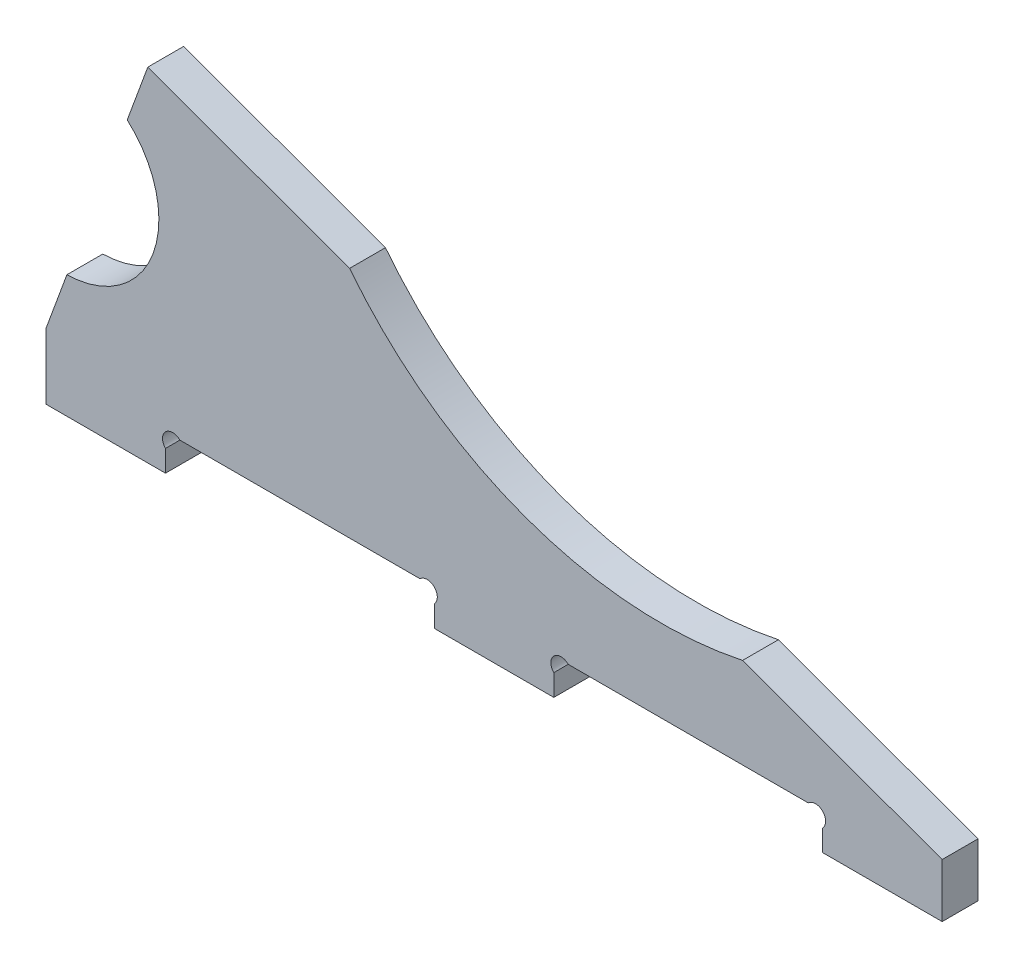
ISO-10303-21;
HEADER;
FILE_DESCRIPTION(('STEP AP214'),'2;1');
FILE_NAME('part.step','',(''),(''),'','','');
FILE_SCHEMA(('AUTOMOTIVE_DESIGN { 1 0 10303 214 1 1 1 1 }'));
ENDSEC;
DATA;
#1=APPLICATION_CONTEXT('core data for automotive mechanical design processes');
#2=APPLICATION_PROTOCOL_DEFINITION('international standard','automotive_design',2000,#1);
#3=PRODUCT_CONTEXT('',#1,'mechanical');
#4=PRODUCT('Part','Part','',(#3));
#5=PRODUCT_RELATED_PRODUCT_CATEGORY('part','',(#4));
#6=PRODUCT_DEFINITION_FORMATION('','',#4);
#7=PRODUCT_DEFINITION_CONTEXT('part definition',#1,'design');
#8=PRODUCT_DEFINITION('design','',#6,#7);
#9=PRODUCT_DEFINITION_SHAPE('','',#8);
#10=(LENGTH_UNIT() NAMED_UNIT(*) SI_UNIT(.MILLI.,.METRE.));
#11=(NAMED_UNIT(*) PLANE_ANGLE_UNIT() SI_UNIT($,.RADIAN.));
#12=(NAMED_UNIT(*) SI_UNIT($,.STERADIAN.) SOLID_ANGLE_UNIT());
#13=UNCERTAINTY_MEASURE_WITH_UNIT(LENGTH_MEASURE(1.E-05),#10,'distance_accuracy_value','');
#14=(GEOMETRIC_REPRESENTATION_CONTEXT(3) GLOBAL_UNCERTAINTY_ASSIGNED_CONTEXT((#13)) GLOBAL_UNIT_ASSIGNED_CONTEXT((#10,
#11,#12)) REPRESENTATION_CONTEXT('',''));
#15=CARTESIAN_POINT('',(0.,0.,0.));
#16=DIRECTION('',(0.,0.,1.));
#17=DIRECTION('',(1.,0.,0.));
#18=AXIS2_PLACEMENT_3D('',#15,#16,#17);
#19=CARTESIAN_POINT('',(116.592002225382,21.1595167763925,6.));
#20=DIRECTION('',(-0.342020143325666,-0.939692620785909,0.));
#21=DIRECTION('',(0.93969262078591,-0.342020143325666,0.));
#22=AXIS2_PLACEMENT_3D('',#19,#20,#21);
#23=PLANE('',#22);
#24=DIRECTION('',(-0.93969262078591,0.342020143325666,0.));
#25=VECTOR('',#24,1.);
#26=CARTESIAN_POINT('',(116.592002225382,21.1595167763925,0.));
#27=LINE('',#26,#25);
#28=CARTESIAN_POINT('',(150.,9.,0.));
#29=VERTEX_POINT('',#28);
#30=CARTESIAN_POINT('',(116.592002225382,21.1595167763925,0.));
#31=VERTEX_POINT('',#30);
#32=EDGE_CURVE('E172',#29,#31,#27,.T.);
#33=ORIENTED_EDGE('',*,*,#32,.T.);
#34=DIRECTION('',(0.,0.,-1.));
#35=VECTOR('',#34,1.);
#36=CARTESIAN_POINT('',(116.592002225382,21.1595167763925,6.));
#37=LINE('',#36,#35);
#38=CARTESIAN_POINT('',(116.592002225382,21.1595167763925,6.));
#39=VERTEX_POINT('',#38);
#40=EDGE_CURVE('E11',#39,#31,#37,.T.);
#41=ORIENTED_EDGE('',*,*,#40,.F.);
#42=DIRECTION('',(-0.93969262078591,0.342020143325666,0.));
#43=VECTOR('',#42,1.);
#44=CARTESIAN_POINT('',(116.592002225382,21.1595167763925,6.));
#45=LINE('',#44,#43);
#46=CARTESIAN_POINT('',(150.,9.,6.));
#47=VERTEX_POINT('',#46);
#48=EDGE_CURVE('E225',#47,#39,#45,.T.);
#49=ORIENTED_EDGE('',*,*,#48,.F.);
#50=DIRECTION('',(0.,0.,-1.));
#51=VECTOR('',#50,1.);
#52=CARTESIAN_POINT('',(150.,9.,6.));
#53=LINE('',#52,#51);
#54=EDGE_CURVE('E185',#47,#29,#53,.T.);
#55=ORIENTED_EDGE('',*,*,#54,.T.);
#56=EDGE_LOOP('',(#33,#41,#49,#55));
#57=FACE_BOUND('',#56,.T.);
#58=ADVANCED_FACE('F26',(#57),#23,.F.);
#59=CARTESIAN_POINT('',(102.941393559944,85.9879317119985,6.));
#60=DIRECTION('',(0.,0.,-1.));
#61=DIRECTION('',(-1.,0.,0.));
#62=AXIS2_PLACEMENT_3D('',#59,#60,#61);
#63=CYLINDRICAL_SURFACE('',#62,66.2500000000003);
#64=CARTESIAN_POINT('',(102.941393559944,85.9879317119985,0.));
#65=DIRECTION('',(0.,0.,-1.));
#66=DIRECTION('',(-1.,0.,0.));
#67=AXIS2_PLACEMENT_3D('',#64,#65,#66);
#68=CIRCLE('',#67,66.2500000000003);
#69=CARTESIAN_POINT('',(50.8135187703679,45.1009268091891,0.));
#70=VERTEX_POINT('',#69);
#71=EDGE_CURVE('E168',#31,#70,#68,.T.);
#72=ORIENTED_EDGE('',*,*,#71,.T.);
#73=DIRECTION('',(0.,0.,-1.));
#74=VECTOR('',#73,1.);
#75=CARTESIAN_POINT('',(50.8135187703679,45.1009268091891,6.));
#76=LINE('',#75,#74);
#77=CARTESIAN_POINT('',(50.8135187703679,45.1009268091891,6.));
#78=VERTEX_POINT('',#77);
#79=EDGE_CURVE('E33',#78,#70,#76,.T.);
#80=ORIENTED_EDGE('',*,*,#79,.F.);
#81=CARTESIAN_POINT('',(102.941393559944,85.9879317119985,6.));
#82=DIRECTION('',(0.,0.,-1.));
#83=DIRECTION('',(-1.,0.,0.));
#84=AXIS2_PLACEMENT_3D('',#81,#82,#83);
#85=CIRCLE('',#84,66.2500000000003);
#86=EDGE_CURVE('E181',#39,#78,#85,.T.);
#87=ORIENTED_EDGE('',*,*,#86,.F.);
#88=ORIENTED_EDGE('',*,*,#40,.T.);
#89=EDGE_LOOP('',(#72,#80,#87,#88));
#90=FACE_BOUND('',#89,.T.);
#91=ADVANCED_FACE('F180',(#90),#63,.F.);
#92=CARTESIAN_POINT('',(17.0424153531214,57.3926032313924,6.));
#93=DIRECTION('',(-0.342020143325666,-0.93969262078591,0.));
#94=DIRECTION('',(0.93969262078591,-0.342020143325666,0.));
#95=AXIS2_PLACEMENT_3D('',#92,#93,#94);
#96=PLANE('',#95);
#97=DIRECTION('',(-0.939692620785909,0.342020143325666,0.));
#98=VECTOR('',#97,1.);
#99=CARTESIAN_POINT('',(17.0424153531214,57.3926032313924,0.));
#100=LINE('',#99,#98);
#101=CARTESIAN_POINT('',(17.0424153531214,57.3926032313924,0.));
#102=VERTEX_POINT('',#101);
#103=EDGE_CURVE('E174',#70,#102,#100,.T.);
#104=ORIENTED_EDGE('',*,*,#103,.T.);
#105=DIRECTION('',(0.,0.,-1.));
#106=VECTOR('',#105,1.);
#107=CARTESIAN_POINT('',(17.0424153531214,57.3926032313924,6.));
#108=LINE('',#107,#106);
#109=CARTESIAN_POINT('',(17.0424153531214,57.3926032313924,6.));
#110=VERTEX_POINT('',#109);
#111=EDGE_CURVE('E316',#110,#102,#108,.T.);
#112=ORIENTED_EDGE('',*,*,#111,.F.);
#113=DIRECTION('',(-0.939692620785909,0.342020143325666,0.));
#114=VECTOR('',#113,1.);
#115=CARTESIAN_POINT('',(17.0424153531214,57.3926032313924,6.));
#116=LINE('',#115,#114);
#117=EDGE_CURVE('E228',#78,#110,#116,.T.);
#118=ORIENTED_EDGE('',*,*,#117,.F.);
#119=ORIENTED_EDGE('',*,*,#79,.T.);
#120=EDGE_LOOP('',(#104,#112,#118,#119));
#121=FACE_BOUND('',#120,.T.);
#122=ADVANCED_FACE('F320',(#121),#96,.F.);
#123=CARTESIAN_POINT('',(13.5941835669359,48.0058792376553,6.));
#124=DIRECTION('',(0.93866822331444,-0.344821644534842,0.));
#125=DIRECTION('',(0.344821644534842,0.93866822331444,0.));
#126=AXIS2_PLACEMENT_3D('',#123,#124,#125);
#127=PLANE('',#126);
#128=DIRECTION('',(-0.344821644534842,-0.93866822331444,0.));
#129=VECTOR('',#128,1.);
#130=CARTESIAN_POINT('',(13.5941835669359,48.0058792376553,0.));
#131=LINE('',#130,#129);
#132=CARTESIAN_POINT('',(13.5941835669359,48.0058792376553,0.));
#133=VERTEX_POINT('',#132);
#134=EDGE_CURVE('E189',#102,#133,#131,.T.);
#135=ORIENTED_EDGE('',*,*,#134,.T.);
#136=DIRECTION('',(0.,0.,-1.));
#137=VECTOR('',#136,1.);
#138=CARTESIAN_POINT('',(13.5941835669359,48.0058792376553,6.));
#139=LINE('',#138,#137);
#140=CARTESIAN_POINT('',(13.5941835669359,48.0058792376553,6.));
#141=VERTEX_POINT('',#140);
#142=EDGE_CURVE('E313',#141,#133,#139,.T.);
#143=ORIENTED_EDGE('',*,*,#142,.F.);
#144=DIRECTION('',(-0.344821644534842,-0.93866822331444,0.));
#145=VECTOR('',#144,1.);
#146=CARTESIAN_POINT('',(13.5941835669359,48.0058792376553,6.));
#147=LINE('',#146,#145);
#148=EDGE_CURVE('E230',#110,#141,#147,.T.);
#149=ORIENTED_EDGE('',*,*,#148,.F.);
#150=ORIENTED_EDGE('',*,*,#111,.T.);
#151=EDGE_LOOP('',(#135,#143,#149,#150));
#152=FACE_BOUND('',#151,.T.);
#153=ADVANCED_FACE('F328',(#152),#127,.F.);
#154=CARTESIAN_POINT('',(3.17954320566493,36.2347977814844,6.));
#155=DIRECTION('',(0.,0.,-1.));
#156=DIRECTION('',(-1.,0.,0.));
#157=AXIS2_PLACEMENT_3D('',#154,#155,#156);
#158=CYLINDRICAL_SURFACE('',#157,15.7169682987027);
#159=CARTESIAN_POINT('',(3.17954320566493,36.2347977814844,0.));
#160=DIRECTION('',(0.,0.,-1.));
#161=DIRECTION('',(-1.,0.,0.));
#162=AXIS2_PLACEMENT_3D('',#159,#160,#161);
#163=CIRCLE('',#162,15.7169682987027);
#164=CARTESIAN_POINT('',(3.49757579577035,20.5210475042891,0.));
#165=VERTEX_POINT('',#164);
#166=EDGE_CURVE('E191',#133,#165,#163,.T.);
#167=ORIENTED_EDGE('',*,*,#166,.T.);
#168=DIRECTION('',(0.,0.,-1.));
#169=VECTOR('',#168,1.);
#170=CARTESIAN_POINT('',(3.49757579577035,20.5210475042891,6.));
#171=LINE('',#170,#169);
#172=CARTESIAN_POINT('',(3.49757579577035,20.5210475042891,6.));
#173=VERTEX_POINT('',#172);
#174=EDGE_CURVE('E310',#173,#165,#171,.T.);
#175=ORIENTED_EDGE('',*,*,#174,.F.);
#176=CARTESIAN_POINT('',(3.17954320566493,36.2347977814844,6.));
#177=DIRECTION('',(0.,0.,-1.));
#178=DIRECTION('',(-1.,0.,0.));
#179=AXIS2_PLACEMENT_3D('',#176,#177,#178);
#180=CIRCLE('',#179,15.7169682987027);
#181=EDGE_CURVE('E232',#141,#173,#180,.T.);
#182=ORIENTED_EDGE('',*,*,#181,.F.);
#183=ORIENTED_EDGE('',*,*,#142,.T.);
#184=EDGE_LOOP('',(#167,#175,#182,#183));
#185=FACE_BOUND('',#184,.T.);
#186=ADVANCED_FACE('F331',(#185),#158,.F.);
#187=CARTESIAN_POINT('',(0.,11.,6.));
#188=DIRECTION('',(0.938668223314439,-0.344821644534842,0.));
#189=DIRECTION('',(0.344821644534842,0.93866822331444,0.));
#190=AXIS2_PLACEMENT_3D('',#187,#188,#189);
#191=PLANE('',#190);
#192=DIRECTION('',(-0.344821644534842,-0.93866822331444,0.));
#193=VECTOR('',#192,1.);
#194=CARTESIAN_POINT('',(0.,11.,0.));
#195=LINE('',#194,#193);
#196=CARTESIAN_POINT('',(0.,11.,0.));
#197=VERTEX_POINT('',#196);
#198=EDGE_CURVE('E193',#165,#197,#195,.T.);
#199=ORIENTED_EDGE('',*,*,#198,.T.);
#200=DIRECTION('',(0.,0.,-1.));
#201=VECTOR('',#200,1.);
#202=CARTESIAN_POINT('',(0.,11.,6.));
#203=LINE('',#202,#201);
#204=CARTESIAN_POINT('',(0.,11.,6.));
#205=VERTEX_POINT('',#204);
#206=EDGE_CURVE('E307',#205,#197,#203,.T.);
#207=ORIENTED_EDGE('',*,*,#206,.F.);
#208=DIRECTION('',(-0.344821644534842,-0.93866822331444,0.));
#209=VECTOR('',#208,1.);
#210=CARTESIAN_POINT('',(0.,11.,6.));
#211=LINE('',#210,#209);
#212=EDGE_CURVE('E234',#173,#205,#211,.T.);
#213=ORIENTED_EDGE('',*,*,#212,.F.);
#214=ORIENTED_EDGE('',*,*,#174,.T.);
#215=EDGE_LOOP('',(#199,#207,#213,#214));
#216=FACE_BOUND('',#215,.T.);
#217=ADVANCED_FACE('F336',(#216),#191,.F.);
#218=CARTESIAN_POINT('',(0.,0.,6.));
#219=DIRECTION('',(1.,0.,0.));
#220=DIRECTION('',(0.,0.,-1.));
#221=AXIS2_PLACEMENT_3D('',#218,#219,#220);
#222=PLANE('',#221);
#223=DIRECTION('',(0.,-1.,0.));
#224=VECTOR('',#223,1.);
#225=CARTESIAN_POINT('',(0.,0.,0.));
#226=LINE('',#225,#224);
#227=CARTESIAN_POINT('',(0.,0.,0.));
#228=VERTEX_POINT('',#227);
#229=EDGE_CURVE('E195',#197,#228,#226,.T.);
#230=ORIENTED_EDGE('',*,*,#229,.T.);
#231=DIRECTION('',(0.,0.,-1.));
#232=VECTOR('',#231,1.);
#233=CARTESIAN_POINT('',(0.,0.,6.));
#234=LINE('',#233,#232);
#235=CARTESIAN_POINT('',(0.,0.,6.));
#236=VERTEX_POINT('',#235);
#237=EDGE_CURVE('E304',#236,#228,#234,.T.);
#238=ORIENTED_EDGE('',*,*,#237,.F.);
#239=DIRECTION('',(0.,-1.,0.));
#240=VECTOR('',#239,1.);
#241=CARTESIAN_POINT('',(0.,0.,6.));
#242=LINE('',#241,#240);
#243=EDGE_CURVE('E236',#205,#236,#242,.T.);
#244=ORIENTED_EDGE('',*,*,#243,.F.);
#245=ORIENTED_EDGE('',*,*,#206,.T.);
#246=EDGE_LOOP('',(#230,#238,#244,#245));
#247=FACE_BOUND('',#246,.T.);
#248=ADVANCED_FACE('F342',(#247),#222,.F.);
#249=CARTESIAN_POINT('',(0.,0.,6.));
#250=DIRECTION('',(0.,1.,0.));
#251=DIRECTION('',(0.,0.,1.));
#252=AXIS2_PLACEMENT_3D('',#249,#250,#251);
#253=PLANE('',#252);
#254=DIRECTION('',(1.,0.,0.));
#255=VECTOR('',#254,1.);
#256=CARTESIAN_POINT('',(0.,0.,0.));
#257=LINE('',#256,#255);
#258=CARTESIAN_POINT('',(20.,0.,0.));
#259=VERTEX_POINT('',#258);
#260=EDGE_CURVE('E197',#228,#259,#257,.T.);
#261=ORIENTED_EDGE('',*,*,#260,.T.);
#262=DIRECTION('',(0.,0.,-1.));
#263=VECTOR('',#262,1.);
#264=CARTESIAN_POINT('',(20.,0.,6.));
#265=LINE('',#264,#263);
#266=CARTESIAN_POINT('',(20.,0.,6.));
#267=VERTEX_POINT('',#266);
#268=EDGE_CURVE('E301',#267,#259,#265,.T.);
#269=ORIENTED_EDGE('',*,*,#268,.F.);
#270=DIRECTION('',(1.,0.,0.));
#271=VECTOR('',#270,1.);
#272=CARTESIAN_POINT('',(0.,0.,6.));
#273=LINE('',#272,#271);
#274=EDGE_CURVE('E238',#236,#267,#273,.T.);
#275=ORIENTED_EDGE('',*,*,#274,.F.);
#276=ORIENTED_EDGE('',*,*,#237,.T.);
#277=EDGE_LOOP('',(#261,#269,#275,#276));
#278=FACE_BOUND('',#277,.T.);
#279=ADVANCED_FACE('F346',(#278),#253,.F.);
#280=CARTESIAN_POINT('',(20.,0.,6.));
#281=DIRECTION('',(-1.,0.,0.));
#282=DIRECTION('',(0.,0.,1.));
#283=AXIS2_PLACEMENT_3D('',#280,#281,#282);
#284=PLANE('',#283);
#285=DIRECTION('',(0.,1.,0.));
#286=VECTOR('',#285,1.);
#287=CARTESIAN_POINT('',(20.,0.,0.));
#288=LINE('',#287,#286);
#289=CARTESIAN_POINT('',(20.,3.59583694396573,0.));
#290=VERTEX_POINT('',#289);
#291=EDGE_CURVE('E199',#259,#290,#288,.T.);
#292=ORIENTED_EDGE('',*,*,#291,.T.);
#293=DIRECTION('',(0.,0.,-1.));
#294=VECTOR('',#293,1.);
#295=CARTESIAN_POINT('',(20.,3.59583694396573,6.));
#296=LINE('',#295,#294);
#297=CARTESIAN_POINT('',(20.,3.59583694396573,6.));
#298=VERTEX_POINT('',#297);
#299=EDGE_CURVE('E298',#298,#290,#296,.T.);
#300=ORIENTED_EDGE('',*,*,#299,.F.);
#301=DIRECTION('',(0.,1.,0.));
#302=VECTOR('',#301,1.);
#303=CARTESIAN_POINT('',(20.,0.,6.));
#304=LINE('',#303,#302);
#305=EDGE_CURVE('E240',#267,#298,#304,.T.);
#306=ORIENTED_EDGE('',*,*,#305,.F.);
#307=ORIENTED_EDGE('',*,*,#268,.T.);
#308=EDGE_LOOP('',(#292,#300,#306,#307));
#309=FACE_BOUND('',#308,.T.);
#310=ADVANCED_FACE('F351',(#309),#284,.F.);
#311=CARTESIAN_POINT('',(21.2020815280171,4.79791847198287,6.));
#312=DIRECTION('',(0.,0.,-1.));
#313=DIRECTION('',(-1.,0.,0.));
#314=AXIS2_PLACEMENT_3D('',#311,#312,#313);
#315=CYLINDRICAL_SURFACE('',#314,1.7);
#316=CARTESIAN_POINT('',(21.2020815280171,4.79791847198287,0.));
#317=DIRECTION('',(0.,0.,-1.));
#318=DIRECTION('',(1.,0.,0.));
#319=AXIS2_PLACEMENT_3D('',#316,#317,#318);
#320=CIRCLE('',#319,1.7);
#321=CARTESIAN_POINT('',(22.4041630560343,6.,0.));
#322=VERTEX_POINT('',#321);
#323=EDGE_CURVE('E201',#290,#322,#320,.T.);
#324=ORIENTED_EDGE('',*,*,#323,.T.);
#325=DIRECTION('',(0.,0.,-1.));
#326=VECTOR('',#325,1.);
#327=CARTESIAN_POINT('',(22.4041630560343,6.,6.));
#328=LINE('',#327,#326);
#329=CARTESIAN_POINT('',(22.4041630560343,6.,6.));
#330=VERTEX_POINT('',#329);
#331=EDGE_CURVE('E295',#330,#322,#328,.T.);
#332=ORIENTED_EDGE('',*,*,#331,.F.);
#333=CARTESIAN_POINT('',(21.2020815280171,4.79791847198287,6.));
#334=DIRECTION('',(0.,0.,-1.));
#335=DIRECTION('',(1.,0.,0.));
#336=AXIS2_PLACEMENT_3D('',#333,#334,#335);
#337=CIRCLE('',#336,1.7);
#338=EDGE_CURVE('E242',#298,#330,#337,.T.);
#339=ORIENTED_EDGE('',*,*,#338,.F.);
#340=ORIENTED_EDGE('',*,*,#299,.T.);
#341=EDGE_LOOP('',(#324,#332,#339,#340));
#342=FACE_BOUND('',#341,.T.);
#343=ADVANCED_FACE('F357',(#342),#315,.F.);
#344=CARTESIAN_POINT('',(22.4041630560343,6.,6.));
#345=DIRECTION('',(0.,1.,0.));
#346=DIRECTION('',(0.,0.,1.));
#347=AXIS2_PLACEMENT_3D('',#344,#345,#346);
#348=PLANE('',#347);
#349=DIRECTION('',(1.,0.,0.));
#350=VECTOR('',#349,1.);
#351=CARTESIAN_POINT('',(22.4041630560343,6.,0.));
#352=LINE('',#351,#350);
#353=CARTESIAN_POINT('',(62.5958369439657,6.,0.));
#354=VERTEX_POINT('',#353);
#355=EDGE_CURVE('E203',#322,#354,#352,.T.);
#356=ORIENTED_EDGE('',*,*,#355,.T.);
#357=DIRECTION('',(0.,0.,-1.));
#358=VECTOR('',#357,1.);
#359=CARTESIAN_POINT('',(62.5958369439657,6.,6.));
#360=LINE('',#359,#358);
#361=CARTESIAN_POINT('',(62.5958369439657,6.,6.));
#362=VERTEX_POINT('',#361);
#363=EDGE_CURVE('E292',#362,#354,#360,.T.);
#364=ORIENTED_EDGE('',*,*,#363,.F.);
#365=DIRECTION('',(1.,0.,0.));
#366=VECTOR('',#365,1.);
#367=CARTESIAN_POINT('',(22.4041630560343,6.,6.));
#368=LINE('',#367,#366);
#369=EDGE_CURVE('E244',#330,#362,#368,.T.);
#370=ORIENTED_EDGE('',*,*,#369,.F.);
#371=ORIENTED_EDGE('',*,*,#331,.T.);
#372=EDGE_LOOP('',(#356,#364,#370,#371));
#373=FACE_BOUND('',#372,.T.);
#374=ADVANCED_FACE('F361',(#373),#348,.F.);
#375=CARTESIAN_POINT('',(63.7979184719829,4.79791847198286,6.));
#376=DIRECTION('',(0.,0.,-1.));
#377=DIRECTION('',(-1.,0.,0.));
#378=AXIS2_PLACEMENT_3D('',#375,#376,#377);
#379=CYLINDRICAL_SURFACE('',#378,1.7);
#380=CARTESIAN_POINT('',(63.7979184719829,4.79791847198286,0.));
#381=DIRECTION('',(0.,0.,-1.));
#382=DIRECTION('',(-1.,0.,0.));
#383=AXIS2_PLACEMENT_3D('',#380,#381,#382);
#384=CIRCLE('',#383,1.7);
#385=CARTESIAN_POINT('',(65.,3.59583694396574,0.));
#386=VERTEX_POINT('',#385);
#387=EDGE_CURVE('E205',#354,#386,#384,.T.);
#388=ORIENTED_EDGE('',*,*,#387,.T.);
#389=DIRECTION('',(0.,0.,-1.));
#390=VECTOR('',#389,1.);
#391=CARTESIAN_POINT('',(65.,3.59583694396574,6.));
#392=LINE('',#391,#390);
#393=CARTESIAN_POINT('',(65.,3.59583694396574,6.));
#394=VERTEX_POINT('',#393);
#395=EDGE_CURVE('E289',#394,#386,#392,.T.);
#396=ORIENTED_EDGE('',*,*,#395,.F.);
#397=CARTESIAN_POINT('',(63.7979184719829,4.79791847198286,6.));
#398=DIRECTION('',(0.,0.,-1.));
#399=DIRECTION('',(-1.,0.,0.));
#400=AXIS2_PLACEMENT_3D('',#397,#398,#399);
#401=CIRCLE('',#400,1.7);
#402=EDGE_CURVE('E246',#362,#394,#401,.T.);
#403=ORIENTED_EDGE('',*,*,#402,.F.);
#404=ORIENTED_EDGE('',*,*,#363,.T.);
#405=EDGE_LOOP('',(#388,#396,#403,#404));
#406=FACE_BOUND('',#405,.T.);
#407=ADVANCED_FACE('F366',(#406),#379,.F.);
#408=CARTESIAN_POINT('',(65.,0.,6.));
#409=DIRECTION('',(1.,0.,0.));
#410=DIRECTION('',(0.,0.,-1.));
#411=AXIS2_PLACEMENT_3D('',#408,#409,#410);
#412=PLANE('',#411);
#413=DIRECTION('',(0.,-1.,0.));
#414=VECTOR('',#413,1.);
#415=CARTESIAN_POINT('',(65.,0.,0.));
#416=LINE('',#415,#414);
#417=CARTESIAN_POINT('',(65.,0.,0.));
#418=VERTEX_POINT('',#417);
#419=EDGE_CURVE('E207',#386,#418,#416,.T.);
#420=ORIENTED_EDGE('',*,*,#419,.T.);
#421=DIRECTION('',(0.,0.,-1.));
#422=VECTOR('',#421,1.);
#423=CARTESIAN_POINT('',(65.,0.,6.));
#424=LINE('',#423,#422);
#425=CARTESIAN_POINT('',(65.,0.,6.));
#426=VERTEX_POINT('',#425);
#427=EDGE_CURVE('E286',#426,#418,#424,.T.);
#428=ORIENTED_EDGE('',*,*,#427,.F.);
#429=DIRECTION('',(0.,-1.,0.));
#430=VECTOR('',#429,1.);
#431=CARTESIAN_POINT('',(65.,0.,6.));
#432=LINE('',#431,#430);
#433=EDGE_CURVE('E248',#394,#426,#432,.T.);
#434=ORIENTED_EDGE('',*,*,#433,.F.);
#435=ORIENTED_EDGE('',*,*,#395,.T.);
#436=EDGE_LOOP('',(#420,#428,#434,#435));
#437=FACE_BOUND('',#436,.T.);
#438=ADVANCED_FACE('F372',(#437),#412,.F.);
#439=CARTESIAN_POINT('',(65.,0.,6.));
#440=DIRECTION('',(0.,1.,0.));
#441=DIRECTION('',(0.,0.,1.));
#442=AXIS2_PLACEMENT_3D('',#439,#440,#441);
#443=PLANE('',#442);
#444=DIRECTION('',(1.,0.,0.));
#445=VECTOR('',#444,1.);
#446=CARTESIAN_POINT('',(65.,0.,0.));
#447=LINE('',#446,#445);
#448=CARTESIAN_POINT('',(85.,0.,0.));
#449=VERTEX_POINT('',#448);
#450=EDGE_CURVE('E209',#418,#449,#447,.T.);
#451=ORIENTED_EDGE('',*,*,#450,.T.);
#452=DIRECTION('',(0.,0.,-1.));
#453=VECTOR('',#452,1.);
#454=CARTESIAN_POINT('',(85.,0.,6.));
#455=LINE('',#454,#453);
#456=CARTESIAN_POINT('',(85.,0.,6.));
#457=VERTEX_POINT('',#456);
#458=EDGE_CURVE('E283',#457,#449,#455,.T.);
#459=ORIENTED_EDGE('',*,*,#458,.F.);
#460=DIRECTION('',(1.,0.,0.));
#461=VECTOR('',#460,1.);
#462=CARTESIAN_POINT('',(65.,0.,6.));
#463=LINE('',#462,#461);
#464=EDGE_CURVE('E250',#426,#457,#463,.T.);
#465=ORIENTED_EDGE('',*,*,#464,.F.);
#466=ORIENTED_EDGE('',*,*,#427,.T.);
#467=EDGE_LOOP('',(#451,#459,#465,#466));
#468=FACE_BOUND('',#467,.T.);
#469=ADVANCED_FACE('F376',(#468),#443,.F.);
#470=CARTESIAN_POINT('',(85.,0.,6.));
#471=DIRECTION('',(-1.,0.,0.));
#472=DIRECTION('',(0.,0.,1.));
#473=AXIS2_PLACEMENT_3D('',#470,#471,#472);
#474=PLANE('',#473);
#475=DIRECTION('',(0.,1.,0.));
#476=VECTOR('',#475,1.);
#477=CARTESIAN_POINT('',(85.,0.,0.));
#478=LINE('',#477,#476);
#479=CARTESIAN_POINT('',(85.,3.59583694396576,0.));
#480=VERTEX_POINT('',#479);
#481=EDGE_CURVE('E211',#449,#480,#478,.T.);
#482=ORIENTED_EDGE('',*,*,#481,.T.);
#483=DIRECTION('',(0.,0.,-1.));
#484=VECTOR('',#483,1.);
#485=CARTESIAN_POINT('',(85.,3.59583694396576,6.));
#486=LINE('',#485,#484);
#487=CARTESIAN_POINT('',(85.,3.59583694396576,6.));
#488=VERTEX_POINT('',#487);
#489=EDGE_CURVE('E280',#488,#480,#486,.T.);
#490=ORIENTED_EDGE('',*,*,#489,.F.);
#491=DIRECTION('',(0.,1.,0.));
#492=VECTOR('',#491,1.);
#493=CARTESIAN_POINT('',(85.,0.,6.));
#494=LINE('',#493,#492);
#495=EDGE_CURVE('E252',#457,#488,#494,.T.);
#496=ORIENTED_EDGE('',*,*,#495,.F.);
#497=ORIENTED_EDGE('',*,*,#458,.T.);
#498=EDGE_LOOP('',(#482,#490,#496,#497));
#499=FACE_BOUND('',#498,.T.);
#500=ADVANCED_FACE('F381',(#499),#474,.F.);
#501=CARTESIAN_POINT('',(86.2020815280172,4.79791847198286,6.));
#502=DIRECTION('',(0.,0.,-1.));
#503=DIRECTION('',(-1.,0.,0.));
#504=AXIS2_PLACEMENT_3D('',#501,#502,#503);
#505=CYLINDRICAL_SURFACE('',#504,1.7);
#506=CARTESIAN_POINT('',(86.2020815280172,4.79791847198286,0.));
#507=DIRECTION('',(0.,0.,-1.));
#508=DIRECTION('',(1.,0.,0.));
#509=AXIS2_PLACEMENT_3D('',#506,#507,#508);
#510=CIRCLE('',#509,1.7);
#511=CARTESIAN_POINT('',(87.4041630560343,6.,0.));
#512=VERTEX_POINT('',#511);
#513=EDGE_CURVE('E213',#480,#512,#510,.T.);
#514=ORIENTED_EDGE('',*,*,#513,.T.);
#515=DIRECTION('',(0.,0.,-1.));
#516=VECTOR('',#515,1.);
#517=CARTESIAN_POINT('',(87.4041630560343,6.,6.));
#518=LINE('',#517,#516);
#519=CARTESIAN_POINT('',(87.4041630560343,6.,6.));
#520=VERTEX_POINT('',#519);
#521=EDGE_CURVE('E277',#520,#512,#518,.T.);
#522=ORIENTED_EDGE('',*,*,#521,.F.);
#523=CARTESIAN_POINT('',(86.2020815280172,4.79791847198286,6.));
#524=DIRECTION('',(0.,0.,-1.));
#525=DIRECTION('',(1.,0.,0.));
#526=AXIS2_PLACEMENT_3D('',#523,#524,#525);
#527=CIRCLE('',#526,1.7);
#528=EDGE_CURVE('E254',#488,#520,#527,.T.);
#529=ORIENTED_EDGE('',*,*,#528,.F.);
#530=ORIENTED_EDGE('',*,*,#489,.T.);
#531=EDGE_LOOP('',(#514,#522,#529,#530));
#532=FACE_BOUND('',#531,.T.);
#533=ADVANCED_FACE('F387',(#532),#505,.F.);
#534=CARTESIAN_POINT('',(87.4041630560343,6.,6.));
#535=DIRECTION('',(0.,1.,0.));
#536=DIRECTION('',(0.,0.,1.));
#537=AXIS2_PLACEMENT_3D('',#534,#535,#536);
#538=PLANE('',#537);
#539=DIRECTION('',(1.,0.,0.));
#540=VECTOR('',#539,1.);
#541=CARTESIAN_POINT('',(87.4041630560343,6.,0.));
#542=LINE('',#541,#540);
#543=CARTESIAN_POINT('',(127.595836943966,6.,0.));
#544=VERTEX_POINT('',#543);
#545=EDGE_CURVE('E215',#512,#544,#542,.T.);
#546=ORIENTED_EDGE('',*,*,#545,.T.);
#547=DIRECTION('',(0.,0.,-1.));
#548=VECTOR('',#547,1.);
#549=CARTESIAN_POINT('',(127.595836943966,6.,6.));
#550=LINE('',#549,#548);
#551=CARTESIAN_POINT('',(127.595836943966,6.,6.));
#552=VERTEX_POINT('',#551);
#553=EDGE_CURVE('E274',#552,#544,#550,.T.);
#554=ORIENTED_EDGE('',*,*,#553,.F.);
#555=DIRECTION('',(1.,0.,0.));
#556=VECTOR('',#555,1.);
#557=CARTESIAN_POINT('',(87.4041630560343,6.,6.));
#558=LINE('',#557,#556);
#559=EDGE_CURVE('E256',#520,#552,#558,.T.);
#560=ORIENTED_EDGE('',*,*,#559,.F.);
#561=ORIENTED_EDGE('',*,*,#521,.T.);
#562=EDGE_LOOP('',(#546,#554,#560,#561));
#563=FACE_BOUND('',#562,.T.);
#564=ADVANCED_FACE('F391',(#563),#538,.F.);
#565=CARTESIAN_POINT('',(128.797918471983,4.79791847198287,6.));
#566=DIRECTION('',(0.,0.,-1.));
#567=DIRECTION('',(-1.,0.,0.));
#568=AXIS2_PLACEMENT_3D('',#565,#566,#567);
#569=CYLINDRICAL_SURFACE('',#568,1.70000000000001);
#570=CARTESIAN_POINT('',(128.797918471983,4.79791847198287,0.));
#571=DIRECTION('',(0.,0.,-1.));
#572=DIRECTION('',(-1.,0.,0.));
#573=AXIS2_PLACEMENT_3D('',#570,#571,#572);
#574=CIRCLE('',#573,1.70000000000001);
#575=CARTESIAN_POINT('',(130.,3.59583694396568,0.));
#576=VERTEX_POINT('',#575);
#577=EDGE_CURVE('E217',#544,#576,#574,.T.);
#578=ORIENTED_EDGE('',*,*,#577,.T.);
#579=DIRECTION('',(0.,0.,-1.));
#580=VECTOR('',#579,1.);
#581=CARTESIAN_POINT('',(130.,3.59583694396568,6.));
#582=LINE('',#581,#580);
#583=CARTESIAN_POINT('',(130.,3.59583694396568,6.));
#584=VERTEX_POINT('',#583);
#585=EDGE_CURVE('E271',#584,#576,#582,.T.);
#586=ORIENTED_EDGE('',*,*,#585,.F.);
#587=CARTESIAN_POINT('',(128.797918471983,4.79791847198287,6.));
#588=DIRECTION('',(0.,0.,-1.));
#589=DIRECTION('',(-1.,0.,0.));
#590=AXIS2_PLACEMENT_3D('',#587,#588,#589);
#591=CIRCLE('',#590,1.70000000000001);
#592=EDGE_CURVE('E258',#552,#584,#591,.T.);
#593=ORIENTED_EDGE('',*,*,#592,.F.);
#594=ORIENTED_EDGE('',*,*,#553,.T.);
#595=EDGE_LOOP('',(#578,#586,#593,#594));
#596=FACE_BOUND('',#595,.T.);
#597=ADVANCED_FACE('F396',(#596),#569,.F.);
#598=CARTESIAN_POINT('',(130.,0.,6.));
#599=DIRECTION('',(1.,0.,0.));
#600=DIRECTION('',(0.,0.,-1.));
#601=AXIS2_PLACEMENT_3D('',#598,#599,#600);
#602=PLANE('',#601);
#603=DIRECTION('',(0.,-1.,0.));
#604=VECTOR('',#603,1.);
#605=CARTESIAN_POINT('',(130.,0.,0.));
#606=LINE('',#605,#604);
#607=CARTESIAN_POINT('',(130.,0.,0.));
#608=VERTEX_POINT('',#607);
#609=EDGE_CURVE('E219',#576,#608,#606,.T.);
#610=ORIENTED_EDGE('',*,*,#609,.T.);
#611=DIRECTION('',(0.,0.,-1.));
#612=VECTOR('',#611,1.);
#613=CARTESIAN_POINT('',(130.,0.,6.));
#614=LINE('',#613,#612);
#615=CARTESIAN_POINT('',(130.,0.,6.));
#616=VERTEX_POINT('',#615);
#617=EDGE_CURVE('E268',#616,#608,#614,.T.);
#618=ORIENTED_EDGE('',*,*,#617,.F.);
#619=DIRECTION('',(0.,-1.,0.));
#620=VECTOR('',#619,1.);
#621=CARTESIAN_POINT('',(130.,0.,6.));
#622=LINE('',#621,#620);
#623=EDGE_CURVE('E260',#584,#616,#622,.T.);
#624=ORIENTED_EDGE('',*,*,#623,.F.);
#625=ORIENTED_EDGE('',*,*,#585,.T.);
#626=EDGE_LOOP('',(#610,#618,#624,#625));
#627=FACE_BOUND('',#626,.T.);
#628=ADVANCED_FACE('F400',(#627),#602,.F.);
#629=CARTESIAN_POINT('',(130.,0.,6.));
#630=DIRECTION('',(0.,1.,0.));
#631=DIRECTION('',(-1.,0.,0.));
#632=AXIS2_PLACEMENT_3D('',#629,#630,#631);
#633=PLANE('',#632);
#634=DIRECTION('',(1.,0.,0.));
#635=VECTOR('',#634,1.);
#636=CARTESIAN_POINT('',(130.,0.,0.));
#637=LINE('',#636,#635);
#638=CARTESIAN_POINT('',(150.,0.,0.));
#639=VERTEX_POINT('',#638);
#640=EDGE_CURVE('E221',#608,#639,#637,.T.);
#641=ORIENTED_EDGE('',*,*,#640,.T.);
#642=DIRECTION('',(0.,0.,-1.));
#643=VECTOR('',#642,1.);
#644=CARTESIAN_POINT('',(150.,0.,6.));
#645=LINE('',#644,#643);
#646=CARTESIAN_POINT('',(150.,0.,6.));
#647=VERTEX_POINT('',#646);
#648=EDGE_CURVE('E265',#647,#639,#645,.T.);
#649=ORIENTED_EDGE('',*,*,#648,.F.);
#650=DIRECTION('',(1.,0.,0.));
#651=VECTOR('',#650,1.);
#652=CARTESIAN_POINT('',(130.,0.,6.));
#653=LINE('',#652,#651);
#654=EDGE_CURVE('E45',#616,#647,#653,.T.);
#655=ORIENTED_EDGE('',*,*,#654,.F.);
#656=ORIENTED_EDGE('',*,*,#617,.T.);
#657=EDGE_LOOP('',(#641,#649,#655,#656));
#658=FACE_BOUND('',#657,.T.);
#659=ADVANCED_FACE('F404',(#658),#633,.F.);
#660=CARTESIAN_POINT('',(150.,0.,6.));
#661=DIRECTION('',(-1.,0.,0.));
#662=DIRECTION('',(0.,0.,1.));
#663=AXIS2_PLACEMENT_3D('',#660,#661,#662);
#664=PLANE('',#663);
#665=DIRECTION('',(0.,1.,0.));
#666=VECTOR('',#665,1.);
#667=CARTESIAN_POINT('',(150.,0.,0.));
#668=LINE('',#667,#666);
#669=EDGE_CURVE('E223',#639,#29,#668,.T.);
#670=ORIENTED_EDGE('',*,*,#669,.T.);
#671=ORIENTED_EDGE('',*,*,#54,.F.);
#672=DIRECTION('',(0.,1.,0.));
#673=VECTOR('',#672,1.);
#674=CARTESIAN_POINT('',(150.,0.,6.));
#675=LINE('',#674,#673);
#676=EDGE_CURVE('E40',#647,#47,#675,.T.);
#677=ORIENTED_EDGE('',*,*,#676,.F.);
#678=ORIENTED_EDGE('',*,*,#648,.T.);
#679=EDGE_LOOP('',(#670,#671,#677,#678));
#680=FACE_BOUND('',#679,.T.);
#681=ADVANCED_FACE('F406',(#680),#664,.F.);
#682=CARTESIAN_POINT('',(128.797918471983,4.79791847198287,6.));
#683=DIRECTION('',(0.,0.,-1.));
#684=DIRECTION('',(-1.,0.,0.));
#685=AXIS2_PLACEMENT_3D('',#682,#683,#684);
#686=PLANE('',#685);
#687=ORIENTED_EDGE('',*,*,#48,.T.);
#688=ORIENTED_EDGE('',*,*,#86,.T.);
#689=ORIENTED_EDGE('',*,*,#117,.T.);
#690=ORIENTED_EDGE('',*,*,#148,.T.);
#691=ORIENTED_EDGE('',*,*,#181,.T.);
#692=ORIENTED_EDGE('',*,*,#212,.T.);
#693=ORIENTED_EDGE('',*,*,#243,.T.);
#694=ORIENTED_EDGE('',*,*,#274,.T.);
#695=ORIENTED_EDGE('',*,*,#305,.T.);
#696=ORIENTED_EDGE('',*,*,#338,.T.);
#697=ORIENTED_EDGE('',*,*,#369,.T.);
#698=ORIENTED_EDGE('',*,*,#402,.T.);
#699=ORIENTED_EDGE('',*,*,#433,.T.);
#700=ORIENTED_EDGE('',*,*,#464,.T.);
#701=ORIENTED_EDGE('',*,*,#495,.T.);
#702=ORIENTED_EDGE('',*,*,#528,.T.);
#703=ORIENTED_EDGE('',*,*,#559,.T.);
#704=ORIENTED_EDGE('',*,*,#592,.T.);
#705=ORIENTED_EDGE('',*,*,#623,.T.);
#706=ORIENTED_EDGE('',*,*,#654,.T.);
#707=ORIENTED_EDGE('',*,*,#676,.T.);
#708=EDGE_LOOP('',(#687,#688,#689,#690,#691,#692,#693,#694,#695,#696,#697,#698,#699,#700,#701,
#702,#703,#704,#705,#706,#707));
#709=FACE_BOUND('',#708,.T.);
#710=ADVANCED_FACE('F323',(#709),#686,.F.);
#711=CARTESIAN_POINT('',(128.797918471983,4.79791847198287,0.));
#712=DIRECTION('',(0.,0.,-1.));
#713=DIRECTION('',(-1.,0.,0.));
#714=AXIS2_PLACEMENT_3D('',#711,#712,#713);
#715=PLANE('',#714);
#716=ORIENTED_EDGE('',*,*,#32,.F.);
#717=ORIENTED_EDGE('',*,*,#669,.F.);
#718=ORIENTED_EDGE('',*,*,#640,.F.);
#719=ORIENTED_EDGE('',*,*,#609,.F.);
#720=ORIENTED_EDGE('',*,*,#577,.F.);
#721=ORIENTED_EDGE('',*,*,#545,.F.);
#722=ORIENTED_EDGE('',*,*,#513,.F.);
#723=ORIENTED_EDGE('',*,*,#481,.F.);
#724=ORIENTED_EDGE('',*,*,#450,.F.);
#725=ORIENTED_EDGE('',*,*,#419,.F.);
#726=ORIENTED_EDGE('',*,*,#387,.F.);
#727=ORIENTED_EDGE('',*,*,#355,.F.);
#728=ORIENTED_EDGE('',*,*,#323,.F.);
#729=ORIENTED_EDGE('',*,*,#291,.F.);
#730=ORIENTED_EDGE('',*,*,#260,.F.);
#731=ORIENTED_EDGE('',*,*,#229,.F.);
#732=ORIENTED_EDGE('',*,*,#198,.F.);
#733=ORIENTED_EDGE('',*,*,#166,.F.);
#734=ORIENTED_EDGE('',*,*,#134,.F.);
#735=ORIENTED_EDGE('',*,*,#103,.F.);
#736=ORIENTED_EDGE('',*,*,#71,.F.);
#737=EDGE_LOOP('',(#716,#717,#718,#719,#720,#721,#722,#723,#724,#725,#726,#727,#728,#729,#730,
#731,#732,#733,#734,#735,#736));
#738=FACE_BOUND('',#737,.T.);
#739=ADVANCED_FACE('F169',(#738),#715,.T.);
#740=CLOSED_SHELL('',(#58,#91,#122,#153,#186,#217,#248,#279,#310,#343,#374,#407,#438,#469,#500,
#533,#564,#597,#628,#659,#681,#710,#739));
#741=MANIFOLD_SOLID_BREP('B2',#740);
#742=ADVANCED_BREP_SHAPE_REPRESENTATION('',(#18,#741),#14);
#743=SHAPE_DEFINITION_REPRESENTATION(#9,#742);
ENDSEC;
END-ISO-10303-21;
